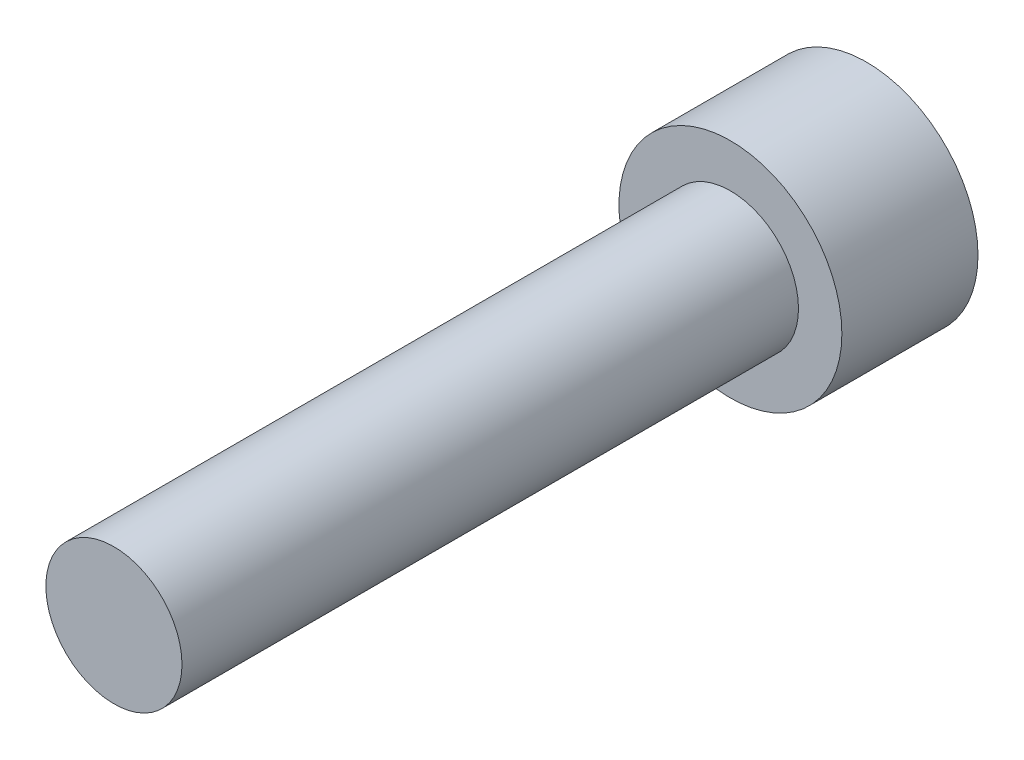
from build123d import *

# Parameters (mm, degrees)
HEX_2_DEPTH = 2.032


with BuildPart() as part:
    # Sketch6 → Revolve1 (revolve)
    with BuildSketch(Plane(origin=(0, 0, 0), x_dir=(0, 0, -1), z_dir=(1, 0, 0)), mode=Mode.PRIVATE) as revolve1_sk:
        Polygon((-15.875, 0), (-15.875, -1.7526), (0, -1.7526), (0, -2.8702), (3.5052, -2.8702), (3.5052, 0), align=None)
    revolve(revolve1_sk.sketch.rotate(Axis((0, 0, 15.875), (0, 0, -1)), 270), axis=Axis((0, 0, 15.875), (0, 0, -1)))

    # Sketch7 → HEX 2 (cut)
    with BuildSketch(Plane(origin=(0, 0, -3.5052), x_dir=(-1, 0, 0), z_dir=(0, 0, -1))):
        Polygon((-1.3843, 0.799225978), (-1.3843, -0.799225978), (0, -1.598451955), (1.3843, -0.799225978), (1.3843, 0.799225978), (0, 1.598451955), align=None)
    extrude(amount=-HEX_2_DEPTH, mode=Mode.SUBTRACT)


solid = part.part
